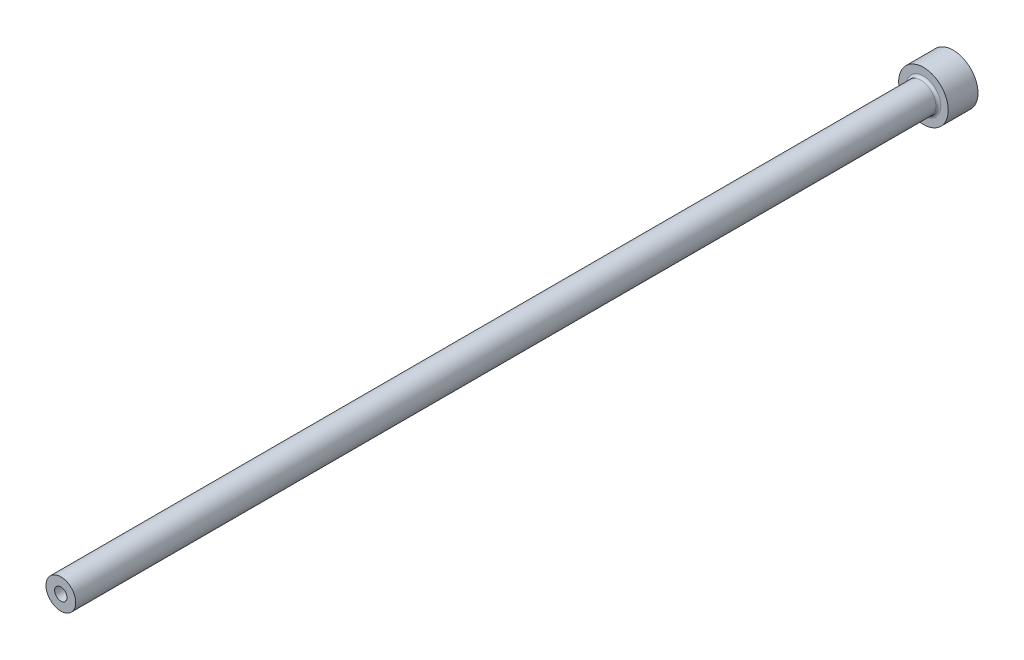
ISO-10303-21;
HEADER;
FILE_DESCRIPTION(('STEP AP214'),'2;1');
FILE_NAME('part.step','',(''),(''),'','','');
FILE_SCHEMA(('AUTOMOTIVE_DESIGN { 1 0 10303 214 1 1 1 1 }'));
ENDSEC;
DATA;
#1=APPLICATION_CONTEXT('core data for automotive mechanical design processes');
#2=APPLICATION_PROTOCOL_DEFINITION('international standard','automotive_design',2000,#1);
#3=PRODUCT_CONTEXT('',#1,'mechanical');
#4=PRODUCT('Part','Part','',(#3));
#5=PRODUCT_RELATED_PRODUCT_CATEGORY('part','',(#4));
#6=PRODUCT_DEFINITION_FORMATION('','',#4);
#7=PRODUCT_DEFINITION_CONTEXT('part definition',#1,'design');
#8=PRODUCT_DEFINITION('design','',#6,#7);
#9=PRODUCT_DEFINITION_SHAPE('','',#8);
#10=(LENGTH_UNIT() NAMED_UNIT(*) SI_UNIT(.MILLI.,.METRE.));
#11=(NAMED_UNIT(*) PLANE_ANGLE_UNIT() SI_UNIT($,.RADIAN.));
#12=(NAMED_UNIT(*) SI_UNIT($,.STERADIAN.) SOLID_ANGLE_UNIT());
#13=UNCERTAINTY_MEASURE_WITH_UNIT(LENGTH_MEASURE(1.E-05),#10,'distance_accuracy_value','');
#14=(GEOMETRIC_REPRESENTATION_CONTEXT(3) GLOBAL_UNCERTAINTY_ASSIGNED_CONTEXT((#13)) GLOBAL_UNIT_ASSIGNED_CONTEXT((#10,
#11,#12)) REPRESENTATION_CONTEXT('',''));
#15=CARTESIAN_POINT('',(0.,0.,0.));
#16=DIRECTION('',(0.,0.,1.));
#17=DIRECTION('',(1.,0.,0.));
#18=AXIS2_PLACEMENT_3D('',#15,#16,#17);
#19=CARTESIAN_POINT('',(0.,0.,180.));
#20=DIRECTION('',(0.,0.,-1.));
#21=DIRECTION('',(-1.,0.,0.));
#22=AXIS2_PLACEMENT_3D('',#19,#20,#21);
#23=PLANE('',#22);
#24=CARTESIAN_POINT('',(0.,0.,180.));
#25=DIRECTION('',(0.,0.,1.));
#26=DIRECTION('',(1.,0.,0.));
#27=AXIS2_PLACEMENT_3D('',#24,#25,#26);
#28=CIRCLE('',#27,1.24999999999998);
#29=CARTESIAN_POINT('',(1.24999999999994,0.,180.));
#30=VERTEX_POINT('',#29);
#31=EDGE_CURVE('E63',#30,#30,#28,.T.);
#32=ORIENTED_EDGE('',*,*,#31,.F.);
#33=EDGE_LOOP('',(#32));
#34=FACE_BOUND('',#33,.T.);
#35=CARTESIAN_POINT('',(0.,0.,180.));
#36=DIRECTION('',(0.,0.,1.));
#37=DIRECTION('',(1.,0.,0.));
#38=AXIS2_PLACEMENT_3D('',#35,#36,#37);
#39=CIRCLE('',#38,2.99999999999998);
#40=CARTESIAN_POINT('',(2.99999999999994,0.,180.));
#41=VERTEX_POINT('',#40);
#42=EDGE_CURVE('E54',#41,#41,#39,.T.);
#43=ORIENTED_EDGE('',*,*,#42,.T.);
#44=EDGE_LOOP('',(#43));
#45=FACE_BOUND('',#44,.T.);
#46=ADVANCED_FACE('F34',(#34,#45),#23,.F.);
#47=CARTESIAN_POINT('',(0.,0.,180.));
#48=DIRECTION('',(0.,0.,1.));
#49=DIRECTION('',(1.,0.,0.));
#50=AXIS2_PLACEMENT_3D('',#47,#48,#49);
#51=CYLINDRICAL_SURFACE('',#50,2.99999999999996);
#52=CARTESIAN_POINT('',(0.,0.,6.50000000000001));
#53=DIRECTION('',(0.,0.,1.));
#54=DIRECTION('',(1.,0.,0.));
#55=AXIS2_PLACEMENT_3D('',#52,#53,#54);
#56=CIRCLE('',#55,2.99999999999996);
#57=CARTESIAN_POINT('',(2.99999999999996,0.,6.50000000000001));
#58=VERTEX_POINT('',#57);
#59=EDGE_CURVE('E49',#58,#58,#56,.T.);
#60=ORIENTED_EDGE('',*,*,#59,.T.);
#61=EDGE_LOOP('',(#60));
#62=FACE_BOUND('',#61,.T.);
#63=ORIENTED_EDGE('',*,*,#42,.F.);
#64=EDGE_LOOP('',(#63));
#65=FACE_BOUND('',#64,.T.);
#66=ADVANCED_FACE('F92',(#62,#65),#51,.T.);
#67=CARTESIAN_POINT('',(0.,0.,6.));
#68=DIRECTION('',(0.,0.,1.));
#69=DIRECTION('',(1.,0.,0.));
#70=AXIS2_PLACEMENT_3D('',#67,#68,#69);
#71=PLANE('',#70);
#72=CARTESIAN_POINT('',(0.,0.,6.));
#73=DIRECTION('',(0.,0.,1.));
#74=DIRECTION('',(1.,0.,0.));
#75=AXIS2_PLACEMENT_3D('',#72,#73,#74);
#76=CIRCLE('',#75,3.49999999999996);
#77=CARTESIAN_POINT('',(3.49999999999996,0.,6.));
#78=VERTEX_POINT('',#77);
#79=EDGE_CURVE('E45',#78,#78,#76,.F.);
#80=ORIENTED_EDGE('',*,*,#79,.T.);
#81=EDGE_LOOP('',(#80));
#82=FACE_BOUND('',#81,.T.);
#83=CARTESIAN_POINT('',(0.,0.,6.00000000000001));
#84=DIRECTION('',(0.,0.,1.));
#85=DIRECTION('',(1.,0.,0.));
#86=AXIS2_PLACEMENT_3D('',#83,#84,#85);
#87=CIRCLE('',#86,4.99999999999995);
#88=CARTESIAN_POINT('',(4.99999999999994,0.,6.00000000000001));
#89=VERTEX_POINT('',#88);
#90=EDGE_CURVE('E57',#89,#89,#87,.T.);
#91=ORIENTED_EDGE('',*,*,#90,.T.);
#92=EDGE_LOOP('',(#91));
#93=FACE_BOUND('',#92,.T.);
#94=ADVANCED_FACE('F98',(#82,#93),#71,.T.);
#95=CARTESIAN_POINT('',(0.,0.,180.));
#96=DIRECTION('',(0.,0.,1.));
#97=DIRECTION('',(1.,0.,0.));
#98=AXIS2_PLACEMENT_3D('',#95,#96,#97);
#99=CYLINDRICAL_SURFACE('',#98,4.99999999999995);
#100=ORIENTED_EDGE('',*,*,#90,.F.);
#101=EDGE_LOOP('',(#100));
#102=FACE_BOUND('',#101,.T.);
#103=CARTESIAN_POINT('',(0.,0.,0.));
#104=DIRECTION('',(0.,0.,1.));
#105=DIRECTION('',(1.,0.,0.));
#106=AXIS2_PLACEMENT_3D('',#103,#104,#105);
#107=CIRCLE('',#106,4.99999999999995);
#108=CARTESIAN_POINT('',(4.99999999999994,0.,0.));
#109=VERTEX_POINT('',#108);
#110=EDGE_CURVE('E60',#109,#109,#107,.T.);
#111=ORIENTED_EDGE('',*,*,#110,.T.);
#112=EDGE_LOOP('',(#111));
#113=FACE_BOUND('',#112,.T.);
#114=ADVANCED_FACE('F89',(#102,#113),#99,.T.);
#115=CARTESIAN_POINT('',(0.,0.,0.));
#116=DIRECTION('',(0.,0.,1.));
#117=DIRECTION('',(1.,0.,0.));
#118=AXIS2_PLACEMENT_3D('',#115,#116,#117);
#119=PLANE('',#118);
#120=CARTESIAN_POINT('',(0.,0.,0.));
#121=DIRECTION('',(0.,0.,1.));
#122=DIRECTION('',(1.,0.,0.));
#123=AXIS2_PLACEMENT_3D('',#120,#121,#122);
#124=CIRCLE('',#123,1.99999999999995);
#125=CARTESIAN_POINT('',(1.99999999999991,0.,0.));
#126=VERTEX_POINT('',#125);
#127=EDGE_CURVE('E41',#126,#126,#124,.T.);
#128=ORIENTED_EDGE('',*,*,#127,.T.);
#129=EDGE_LOOP('',(#128));
#130=FACE_BOUND('',#129,.T.);
#131=ORIENTED_EDGE('',*,*,#110,.F.);
#132=EDGE_LOOP('',(#131));
#133=FACE_BOUND('',#132,.T.);
#134=ADVANCED_FACE('F83',(#130,#133),#119,.F.);
#135=CARTESIAN_POINT('',(0.,0.,180.));
#136=DIRECTION('',(0.,0.,1.));
#137=DIRECTION('',(1.,0.,0.));
#138=AXIS2_PLACEMENT_3D('',#135,#136,#137);
#139=CYLINDRICAL_SURFACE('',#138,1.24999999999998);
#140=ORIENTED_EDGE('',*,*,#31,.T.);
#141=EDGE_LOOP('',(#140));
#142=FACE_BOUND('',#141,.T.);
#143=CARTESIAN_POINT('',(0.,0.,105.));
#144=DIRECTION('',(0.,0.,1.));
#145=DIRECTION('',(1.,0.,0.));
#146=AXIS2_PLACEMENT_3D('',#143,#144,#145);
#147=CIRCLE('',#146,1.24999999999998);
#148=CARTESIAN_POINT('',(1.24999999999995,0.,105.));
#149=VERTEX_POINT('',#148);
#150=EDGE_CURVE('E66',#149,#149,#147,.T.);
#151=ORIENTED_EDGE('',*,*,#150,.F.);
#152=EDGE_LOOP('',(#151));
#153=FACE_BOUND('',#152,.T.);
#154=ADVANCED_FACE('F78',(#142,#153),#139,.F.);
#155=CARTESIAN_POINT('',(0.,0.,105.));
#156=DIRECTION('',(0.,0.,-1.));
#157=DIRECTION('',(-1.,0.,0.));
#158=AXIS2_PLACEMENT_3D('',#155,#156,#157);
#159=CONICAL_SURFACE('',#158,1.24999999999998,0.523598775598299);
#160=CARTESIAN_POINT('',(0.,0.,104.566987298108));
#161=DIRECTION('',(0.,0.,1.));
#162=DIRECTION('',(1.,0.,0.));
#163=AXIS2_PLACEMENT_3D('',#160,#161,#162);
#164=CIRCLE('',#163,1.49999999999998);
#165=CARTESIAN_POINT('',(1.49999999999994,0.,104.566987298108));
#166=VERTEX_POINT('',#165);
#167=EDGE_CURVE('E69',#166,#166,#164,.T.);
#168=ORIENTED_EDGE('',*,*,#167,.F.);
#169=EDGE_LOOP('',(#168));
#170=FACE_BOUND('',#169,.T.);
#171=ORIENTED_EDGE('',*,*,#150,.T.);
#172=EDGE_LOOP('',(#171));
#173=FACE_BOUND('',#172,.T.);
#174=ADVANCED_FACE('F75',(#170,#173),#159,.F.);
#175=CARTESIAN_POINT('',(0.,0.,180.));
#176=DIRECTION('',(0.,0.,1.));
#177=DIRECTION('',(1.,0.,0.));
#178=AXIS2_PLACEMENT_3D('',#175,#176,#177);
#179=CYLINDRICAL_SURFACE('',#178,1.49999999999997);
#180=CARTESIAN_POINT('',(0.,0.,0.499999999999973));
#181=DIRECTION('',(0.,0.,1.));
#182=DIRECTION('',(1.,0.,0.));
#183=AXIS2_PLACEMENT_3D('',#180,#181,#182);
#184=CIRCLE('',#183,1.49999999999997);
#185=CARTESIAN_POINT('',(1.49999999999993,0.,0.499999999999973));
#186=VERTEX_POINT('',#185);
#187=EDGE_CURVE('E10',#186,#186,#184,.F.);
#188=ORIENTED_EDGE('',*,*,#187,.T.);
#189=EDGE_LOOP('',(#188));
#190=FACE_BOUND('',#189,.T.);
#191=ORIENTED_EDGE('',*,*,#167,.T.);
#192=EDGE_LOOP('',(#191));
#193=FACE_BOUND('',#192,.T.);
#194=ADVANCED_FACE('F73',(#190,#193),#179,.F.);
#195=CARTESIAN_POINT('',(0.,0.,6.50000000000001));
#196=DIRECTION('',(0.,0.,1.));
#197=DIRECTION('',(1.,0.,0.));
#198=AXIS2_PLACEMENT_3D('',#195,#196,#197);
#199=TOROIDAL_SURFACE('',#198,3.49999999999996,0.5);
#200=ORIENTED_EDGE('',*,*,#79,.F.);
#201=EDGE_LOOP('',(#200));
#202=FACE_BOUND('',#201,.T.);
#203=ORIENTED_EDGE('',*,*,#59,.F.);
#204=EDGE_LOOP('',(#203));
#205=FACE_BOUND('',#204,.T.);
#206=ADVANCED_FACE('F104',(#202,#205),#199,.F.);
#207=CARTESIAN_POINT('',(0.,0.,0.));
#208=DIRECTION('',(0.,0.,-1.));
#209=DIRECTION('',(-1.,0.,0.));
#210=AXIS2_PLACEMENT_3D('',#207,#208,#209);
#211=CONICAL_SURFACE('',#210,1.99999999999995,0.785398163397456);
#212=ORIENTED_EDGE('',*,*,#187,.F.);
#213=EDGE_LOOP('',(#212));
#214=FACE_BOUND('',#213,.T.);
#215=ORIENTED_EDGE('',*,*,#127,.F.);
#216=EDGE_LOOP('',(#215));
#217=FACE_BOUND('',#216,.T.);
#218=ADVANCED_FACE('F36',(#214,#217),#211,.F.);
#219=CLOSED_SHELL('',(#46,#66,#94,#114,#134,#154,#174,#194,#206,#218));
#220=MANIFOLD_SOLID_BREP('B2',#219);
#221=ADVANCED_BREP_SHAPE_REPRESENTATION('',(#18,#220),#14);
#222=SHAPE_DEFINITION_REPRESENTATION(#9,#221);
ENDSEC;
END-ISO-10303-21;
